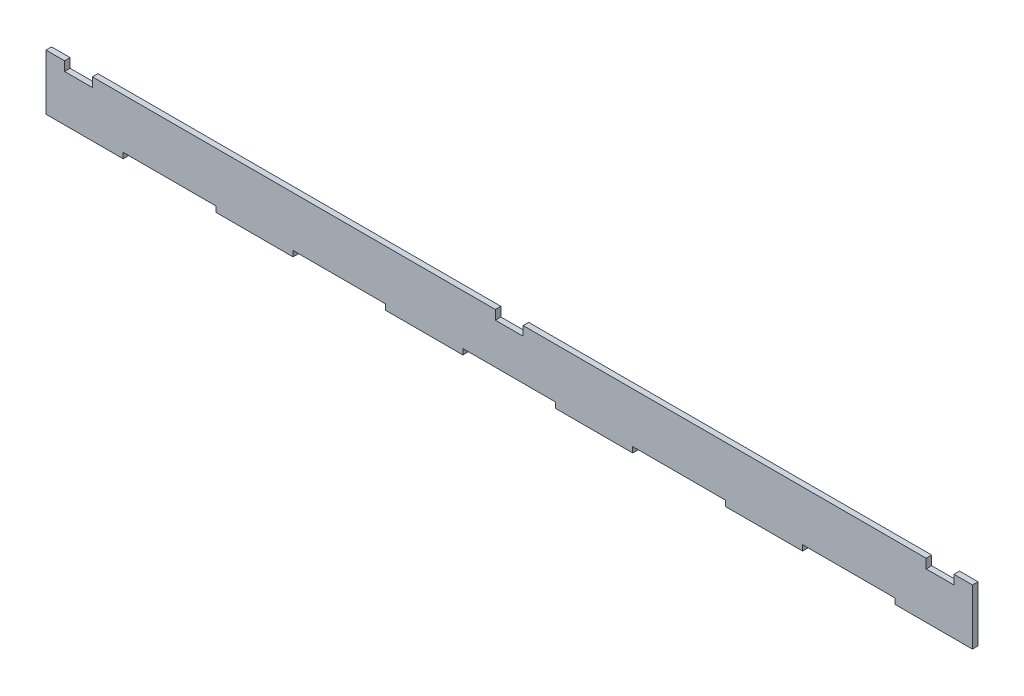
ISO-10303-21;
HEADER;
FILE_DESCRIPTION(('STEP AP214'),'2;1');
FILE_NAME('part.step','',(''),(''),'','','');
FILE_SCHEMA(('AUTOMOTIVE_DESIGN { 1 0 10303 214 1 1 1 1 }'));
ENDSEC;
DATA;
#1=APPLICATION_CONTEXT('core data for automotive mechanical design processes');
#2=APPLICATION_PROTOCOL_DEFINITION('international standard','automotive_design',2000,#1);
#3=PRODUCT_CONTEXT('',#1,'mechanical');
#4=PRODUCT('Part','Part','',(#3));
#5=PRODUCT_RELATED_PRODUCT_CATEGORY('part','',(#4));
#6=PRODUCT_DEFINITION_FORMATION('','',#4);
#7=PRODUCT_DEFINITION_CONTEXT('part definition',#1,'design');
#8=PRODUCT_DEFINITION('design','',#6,#7);
#9=PRODUCT_DEFINITION_SHAPE('','',#8);
#10=(LENGTH_UNIT() NAMED_UNIT(*) SI_UNIT(.MILLI.,.METRE.));
#11=(NAMED_UNIT(*) PLANE_ANGLE_UNIT() SI_UNIT($,.RADIAN.));
#12=(NAMED_UNIT(*) SI_UNIT($,.STERADIAN.) SOLID_ANGLE_UNIT());
#13=UNCERTAINTY_MEASURE_WITH_UNIT(LENGTH_MEASURE(1.E-05),#10,'distance_accuracy_value','');
#14=(GEOMETRIC_REPRESENTATION_CONTEXT(3) GLOBAL_UNCERTAINTY_ASSIGNED_CONTEXT((#13)) GLOBAL_UNIT_ASSIGNED_CONTEXT((#10,
#11,#12)) REPRESENTATION_CONTEXT('',''));
#15=CARTESIAN_POINT('',(0.,0.,0.));
#16=DIRECTION('',(0.,0.,1.));
#17=DIRECTION('',(1.,0.,0.));
#18=AXIS2_PLACEMENT_3D('',#15,#16,#17);
#19=CARTESIAN_POINT('',(0.,30.,3.));
#20=DIRECTION('',(0.,0.,-1.));
#21=DIRECTION('',(-1.,0.,0.));
#22=AXIS2_PLACEMENT_3D('',#19,#20,#21);
#23=PLANE('',#22);
#24=DIRECTION('',(0.,-1.,0.));
#25=VECTOR('',#24,1.);
#26=CARTESIAN_POINT('',(458.333333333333,0.,3.));
#27=LINE('',#26,#25);
#28=CARTESIAN_POINT('',(458.333333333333,3.,3.));
#29=VERTEX_POINT('',#28);
#30=CARTESIAN_POINT('',(458.333333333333,0.,3.));
#31=VERTEX_POINT('',#30);
#32=EDGE_CURVE('E540',#29,#31,#27,.T.);
#33=ORIENTED_EDGE('',*,*,#32,.T.);
#34=DIRECTION('',(1.,0.,0.));
#35=VECTOR('',#34,1.);
#36=CARTESIAN_POINT('',(0.,0.,3.));
#37=LINE('',#36,#35);
#38=CARTESIAN_POINT('',(500.,0.,3.));
#39=VERTEX_POINT('',#38);
#40=EDGE_CURVE('E348',#31,#39,#37,.T.);
#41=ORIENTED_EDGE('',*,*,#40,.T.);
#42=DIRECTION('',(0.,1.,0.));
#43=VECTOR('',#42,1.);
#44=CARTESIAN_POINT('',(500.,0.,3.));
#45=LINE('',#44,#43);
#46=CARTESIAN_POINT('',(500.,30.,3.));
#47=VERTEX_POINT('',#46);
#48=EDGE_CURVE('E320',#39,#47,#45,.T.);
#49=ORIENTED_EDGE('',*,*,#48,.T.);
#50=DIRECTION('',(-1.,0.,0.));
#51=VECTOR('',#50,1.);
#52=CARTESIAN_POINT('',(0.,30.,3.));
#53=LINE('',#52,#51);
#54=CARTESIAN_POINT('',(490.,30.,3.));
#55=VERTEX_POINT('',#54);
#56=EDGE_CURVE('E311',#47,#55,#53,.T.);
#57=ORIENTED_EDGE('',*,*,#56,.T.);
#58=DIRECTION('',(0.,-1.,0.));
#59=VECTOR('',#58,1.);
#60=CARTESIAN_POINT('',(490.,30.,2.99999999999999));
#61=LINE('',#60,#59);
#62=CARTESIAN_POINT('',(490.,25.,2.99999999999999));
#63=VERTEX_POINT('',#62);
#64=EDGE_CURVE('E408',#55,#63,#61,.T.);
#65=ORIENTED_EDGE('',*,*,#64,.T.);
#66=DIRECTION('',(-1.,0.,0.));
#67=VECTOR('',#66,1.);
#68=CARTESIAN_POINT('',(475.,25.,2.99999999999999));
#69=LINE('',#68,#67);
#70=CARTESIAN_POINT('',(475.,25.,2.99999999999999));
#71=VERTEX_POINT('',#70);
#72=EDGE_CURVE('E412',#63,#71,#69,.T.);
#73=ORIENTED_EDGE('',*,*,#72,.T.);
#74=DIRECTION('',(0.,1.,0.));
#75=VECTOR('',#74,1.);
#76=CARTESIAN_POINT('',(475.,30.,2.99999999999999));
#77=LINE('',#76,#75);
#78=CARTESIAN_POINT('',(475.,30.,2.99999999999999));
#79=VERTEX_POINT('',#78);
#80=EDGE_CURVE('E419',#71,#79,#77,.T.);
#81=ORIENTED_EDGE('',*,*,#80,.T.);
#82=CARTESIAN_POINT('',(257.5,30.,3.));
#83=VERTEX_POINT('',#82);
#84=EDGE_CURVE('E336',#79,#83,#53,.T.);
#85=ORIENTED_EDGE('',*,*,#84,.T.);
#86=DIRECTION('',(0.,-1.,0.));
#87=VECTOR('',#86,1.);
#88=CARTESIAN_POINT('',(257.5,30.,3.));
#89=LINE('',#88,#87);
#90=CARTESIAN_POINT('',(257.5,25.,3.));
#91=VERTEX_POINT('',#90);
#92=EDGE_CURVE('E372',#83,#91,#89,.T.);
#93=ORIENTED_EDGE('',*,*,#92,.T.);
#94=DIRECTION('',(-1.,0.,0.));
#95=VECTOR('',#94,1.);
#96=CARTESIAN_POINT('',(242.5,25.,3.));
#97=LINE('',#96,#95);
#98=CARTESIAN_POINT('',(242.5,25.,3.));
#99=VERTEX_POINT('',#98);
#100=EDGE_CURVE('E388',#91,#99,#97,.T.);
#101=ORIENTED_EDGE('',*,*,#100,.T.);
#102=DIRECTION('',(0.,1.,0.));
#103=VECTOR('',#102,1.);
#104=CARTESIAN_POINT('',(242.5,30.,3.));
#105=LINE('',#104,#103);
#106=CARTESIAN_POINT('',(242.5,30.,3.));
#107=VERTEX_POINT('',#106);
#108=EDGE_CURVE('E396',#99,#107,#105,.T.);
#109=ORIENTED_EDGE('',*,*,#108,.T.);
#110=CARTESIAN_POINT('',(25.,30.,3.00000000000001));
#111=VERTEX_POINT('',#110);
#112=EDGE_CURVE('E338',#107,#111,#53,.T.);
#113=ORIENTED_EDGE('',*,*,#112,.T.);
#114=DIRECTION('',(0.,-1.,0.));
#115=VECTOR('',#114,1.);
#116=CARTESIAN_POINT('',(25.,30.,3.));
#117=LINE('',#116,#115);
#118=CARTESIAN_POINT('',(25.,25.,3.));
#119=VERTEX_POINT('',#118);
#120=EDGE_CURVE('E354',#111,#119,#117,.T.);
#121=ORIENTED_EDGE('',*,*,#120,.T.);
#122=DIRECTION('',(-1.,0.,0.));
#123=VECTOR('',#122,1.);
#124=CARTESIAN_POINT('',(10.,25.,3.));
#125=LINE('',#124,#123);
#126=CARTESIAN_POINT('',(10.,25.,3.));
#127=VERTEX_POINT('',#126);
#128=EDGE_CURVE('E375',#119,#127,#125,.T.);
#129=ORIENTED_EDGE('',*,*,#128,.T.);
#130=DIRECTION('',(0.,1.,0.));
#131=VECTOR('',#130,1.);
#132=CARTESIAN_POINT('',(10.,30.,3.));
#133=LINE('',#132,#131);
#134=CARTESIAN_POINT('',(10.,30.,3.));
#135=VERTEX_POINT('',#134);
#136=EDGE_CURVE('E373',#127,#135,#133,.T.);
#137=ORIENTED_EDGE('',*,*,#136,.T.);
#138=CARTESIAN_POINT('',(0.,30.,3.));
#139=VERTEX_POINT('',#138);
#140=EDGE_CURVE('E337',#135,#139,#53,.T.);
#141=ORIENTED_EDGE('',*,*,#140,.T.);
#142=DIRECTION('',(0.,-1.,0.));
#143=VECTOR('',#142,1.);
#144=CARTESIAN_POINT('',(0.,0.,3.));
#145=LINE('',#144,#143);
#146=CARTESIAN_POINT('',(0.,0.,3.));
#147=VERTEX_POINT('',#146);
#148=EDGE_CURVE('E305',#139,#147,#145,.T.);
#149=ORIENTED_EDGE('',*,*,#148,.T.);
#150=CARTESIAN_POINT('',(41.6666666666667,0.,3.));
#151=VERTEX_POINT('',#150);
#152=EDGE_CURVE('E344',#147,#151,#37,.T.);
#153=ORIENTED_EDGE('',*,*,#152,.T.);
#154=DIRECTION('',(0.,1.,0.));
#155=VECTOR('',#154,1.);
#156=CARTESIAN_POINT('',(41.6666666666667,0.,3.));
#157=LINE('',#156,#155);
#158=CARTESIAN_POINT('',(41.6666666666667,3.,3.));
#159=VERTEX_POINT('',#158);
#160=EDGE_CURVE('E431',#151,#159,#157,.T.);
#161=ORIENTED_EDGE('',*,*,#160,.T.);
#162=DIRECTION('',(1.,0.,0.));
#163=VECTOR('',#162,1.);
#164=CARTESIAN_POINT('',(41.6666666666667,3.,3.));
#165=LINE('',#164,#163);
#166=CARTESIAN_POINT('',(91.6666666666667,3.,3.));
#167=VERTEX_POINT('',#166);
#168=EDGE_CURVE('E432',#159,#167,#165,.T.);
#169=ORIENTED_EDGE('',*,*,#168,.T.);
#170=DIRECTION('',(0.,-1.,0.));
#171=VECTOR('',#170,1.);
#172=CARTESIAN_POINT('',(91.6666666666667,0.,3.));
#173=LINE('',#172,#171);
#174=CARTESIAN_POINT('',(91.6666666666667,0.,3.));
#175=VERTEX_POINT('',#174);
#176=EDGE_CURVE('E435',#167,#175,#173,.T.);
#177=ORIENTED_EDGE('',*,*,#176,.T.);
#178=CARTESIAN_POINT('',(133.333333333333,0.,3.));
#179=VERTEX_POINT('',#178);
#180=EDGE_CURVE('E346',#175,#179,#37,.T.);
#181=ORIENTED_EDGE('',*,*,#180,.T.);
#182=DIRECTION('',(0.,1.,0.));
#183=VECTOR('',#182,1.);
#184=CARTESIAN_POINT('',(133.333333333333,0.,3.));
#185=LINE('',#184,#183);
#186=CARTESIAN_POINT('',(133.333333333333,3.,3.));
#187=VERTEX_POINT('',#186);
#188=EDGE_CURVE('E476',#179,#187,#185,.T.);
#189=ORIENTED_EDGE('',*,*,#188,.T.);
#190=DIRECTION('',(1.,0.,0.));
#191=VECTOR('',#190,1.);
#192=CARTESIAN_POINT('',(133.333333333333,3.,3.));
#193=LINE('',#192,#191);
#194=CARTESIAN_POINT('',(183.333333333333,3.,3.));
#195=VERTEX_POINT('',#194);
#196=EDGE_CURVE('E467',#187,#195,#193,.T.);
#197=ORIENTED_EDGE('',*,*,#196,.T.);
#198=DIRECTION('',(0.,-1.,0.));
#199=VECTOR('',#198,1.);
#200=CARTESIAN_POINT('',(183.333333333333,0.,3.));
#201=LINE('',#200,#199);
#202=CARTESIAN_POINT('',(183.333333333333,0.,3.));
#203=VERTEX_POINT('',#202);
#204=EDGE_CURVE('E454',#195,#203,#201,.T.);
#205=ORIENTED_EDGE('',*,*,#204,.T.);
#206=CARTESIAN_POINT('',(225.,0.,3.));
#207=VERTEX_POINT('',#206);
#208=EDGE_CURVE('E564',#203,#207,#37,.T.);
#209=ORIENTED_EDGE('',*,*,#208,.T.);
#210=DIRECTION('',(0.,1.,0.));
#211=VECTOR('',#210,1.);
#212=CARTESIAN_POINT('',(225.,0.,3.));
#213=LINE('',#212,#211);
#214=CARTESIAN_POINT('',(225.,3.,3.));
#215=VERTEX_POINT('',#214);
#216=EDGE_CURVE('E505',#207,#215,#213,.T.);
#217=ORIENTED_EDGE('',*,*,#216,.T.);
#218=DIRECTION('',(1.,0.,0.));
#219=VECTOR('',#218,1.);
#220=CARTESIAN_POINT('',(225.,3.,3.));
#221=LINE('',#220,#219);
#222=CARTESIAN_POINT('',(275.,3.,3.));
#223=VERTEX_POINT('',#222);
#224=EDGE_CURVE('E496',#215,#223,#221,.T.);
#225=ORIENTED_EDGE('',*,*,#224,.T.);
#226=DIRECTION('',(0.,-1.,0.));
#227=VECTOR('',#226,1.);
#228=CARTESIAN_POINT('',(275.,0.,3.));
#229=LINE('',#228,#227);
#230=CARTESIAN_POINT('',(275.,0.,3.));
#231=VERTEX_POINT('',#230);
#232=EDGE_CURVE('E487',#223,#231,#229,.T.);
#233=ORIENTED_EDGE('',*,*,#232,.T.);
#234=CARTESIAN_POINT('',(316.666666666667,0.,3.));
#235=VERTEX_POINT('',#234);
#236=EDGE_CURVE('E562',#231,#235,#37,.T.);
#237=ORIENTED_EDGE('',*,*,#236,.T.);
#238=DIRECTION('',(0.,1.,0.));
#239=VECTOR('',#238,1.);
#240=CARTESIAN_POINT('',(316.666666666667,0.,3.));
#241=LINE('',#240,#239);
#242=CARTESIAN_POINT('',(316.666666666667,3.,3.));
#243=VERTEX_POINT('',#242);
#244=EDGE_CURVE('E56',#235,#243,#241,.T.);
#245=ORIENTED_EDGE('',*,*,#244,.T.);
#246=DIRECTION('',(1.,0.,0.));
#247=VECTOR('',#246,1.);
#248=CARTESIAN_POINT('',(316.666666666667,3.,3.));
#249=LINE('',#248,#247);
#250=CARTESIAN_POINT('',(366.666666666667,3.,3.));
#251=VERTEX_POINT('',#250);
#252=EDGE_CURVE('E522',#243,#251,#249,.T.);
#253=ORIENTED_EDGE('',*,*,#252,.T.);
#254=DIRECTION('',(0.,-1.,0.));
#255=VECTOR('',#254,1.);
#256=CARTESIAN_POINT('',(366.666666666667,0.,3.));
#257=LINE('',#256,#255);
#258=CARTESIAN_POINT('',(366.666666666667,0.,3.));
#259=VERTEX_POINT('',#258);
#260=EDGE_CURVE('E516',#251,#259,#257,.T.);
#261=ORIENTED_EDGE('',*,*,#260,.T.);
#262=CARTESIAN_POINT('',(408.333333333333,0.,3.));
#263=VERTEX_POINT('',#262);
#264=EDGE_CURVE('E560',#259,#263,#37,.T.);
#265=ORIENTED_EDGE('',*,*,#264,.T.);
#266=DIRECTION('',(0.,1.,0.));
#267=VECTOR('',#266,1.);
#268=CARTESIAN_POINT('',(408.333333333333,0.,3.));
#269=LINE('',#268,#267);
#270=CARTESIAN_POINT('',(408.333333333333,3.,3.));
#271=VERTEX_POINT('',#270);
#272=EDGE_CURVE('E48',#263,#271,#269,.T.);
#273=ORIENTED_EDGE('',*,*,#272,.T.);
#274=DIRECTION('',(1.,0.,0.));
#275=VECTOR('',#274,1.);
#276=CARTESIAN_POINT('',(408.333333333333,3.,3.));
#277=LINE('',#276,#275);
#278=EDGE_CURVE('E548',#271,#29,#277,.T.);
#279=ORIENTED_EDGE('',*,*,#278,.T.);
#280=EDGE_LOOP('',(#33,#41,#49,#57,#65,#73,#81,#85,#93,#101,#109,#113,#121,#129,#137,#141,#149,
#153,#161,#169,#177,#181,#189,#197,#205,#209,#217,#225,#233,#237,#245,#253,#261,#265,#273,#279));
#281=FACE_BOUND('',#280,.T.);
#282=ADVANCED_FACE('F33',(#281),#23,.F.);
#283=CARTESIAN_POINT('',(0.,30.,0.));
#284=DIRECTION('',(0.,0.,-1.));
#285=DIRECTION('',(-1.,0.,0.));
#286=AXIS2_PLACEMENT_3D('',#283,#284,#285);
#287=PLANE('',#286);
#288=DIRECTION('',(1.,0.,0.));
#289=VECTOR('',#288,1.);
#290=CARTESIAN_POINT('',(0.,0.,0.));
#291=LINE('',#290,#289);
#292=CARTESIAN_POINT('',(458.333333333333,0.,0.));
#293=VERTEX_POINT('',#292);
#294=CARTESIAN_POINT('',(500.,0.,0.));
#295=VERTEX_POINT('',#294);
#296=EDGE_CURVE('E288',#293,#295,#291,.T.);
#297=ORIENTED_EDGE('',*,*,#296,.F.);
#298=DIRECTION('',(0.,1.,0.));
#299=VECTOR('',#298,1.);
#300=CARTESIAN_POINT('',(458.333333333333,0.,0.));
#301=LINE('',#300,#299);
#302=CARTESIAN_POINT('',(458.333333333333,3.,0.));
#303=VERTEX_POINT('',#302);
#304=EDGE_CURVE('E546',#293,#303,#301,.T.);
#305=ORIENTED_EDGE('',*,*,#304,.T.);
#306=DIRECTION('',(-1.,0.,0.));
#307=VECTOR('',#306,1.);
#308=CARTESIAN_POINT('',(408.333333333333,3.,0.));
#309=LINE('',#308,#307);
#310=CARTESIAN_POINT('',(408.333333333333,3.,0.));
#311=VERTEX_POINT('',#310);
#312=EDGE_CURVE('E281',#303,#311,#309,.T.);
#313=ORIENTED_EDGE('',*,*,#312,.T.);
#314=DIRECTION('',(0.,-1.,0.));
#315=VECTOR('',#314,1.);
#316=CARTESIAN_POINT('',(408.333333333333,0.,0.));
#317=LINE('',#316,#315);
#318=CARTESIAN_POINT('',(408.333333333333,0.,0.));
#319=VERTEX_POINT('',#318);
#320=EDGE_CURVE('E266',#311,#319,#317,.T.);
#321=ORIENTED_EDGE('',*,*,#320,.T.);
#322=CARTESIAN_POINT('',(366.666666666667,0.,0.));
#323=VERTEX_POINT('',#322);
#324=EDGE_CURVE('E279',#323,#319,#291,.T.);
#325=ORIENTED_EDGE('',*,*,#324,.F.);
#326=DIRECTION('',(0.,1.,0.));
#327=VECTOR('',#326,1.);
#328=CARTESIAN_POINT('',(366.666666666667,0.,0.));
#329=LINE('',#328,#327);
#330=CARTESIAN_POINT('',(366.666666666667,3.,0.));
#331=VERTEX_POINT('',#330);
#332=EDGE_CURVE('E520',#323,#331,#329,.T.);
#333=ORIENTED_EDGE('',*,*,#332,.T.);
#334=DIRECTION('',(-1.,0.,0.));
#335=VECTOR('',#334,1.);
#336=CARTESIAN_POINT('',(316.666666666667,3.,0.));
#337=LINE('',#336,#335);
#338=CARTESIAN_POINT('',(316.666666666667,3.,0.));
#339=VERTEX_POINT('',#338);
#340=EDGE_CURVE('E528',#331,#339,#337,.T.);
#341=ORIENTED_EDGE('',*,*,#340,.T.);
#342=DIRECTION('',(0.,-1.,0.));
#343=VECTOR('',#342,1.);
#344=CARTESIAN_POINT('',(316.666666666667,0.,0.));
#345=LINE('',#344,#343);
#346=CARTESIAN_POINT('',(316.666666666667,0.,0.));
#347=VERTEX_POINT('',#346);
#348=EDGE_CURVE('E535',#339,#347,#345,.T.);
#349=ORIENTED_EDGE('',*,*,#348,.T.);
#350=CARTESIAN_POINT('',(275.,0.,0.));
#351=VERTEX_POINT('',#350);
#352=EDGE_CURVE('E287',#351,#347,#291,.T.);
#353=ORIENTED_EDGE('',*,*,#352,.F.);
#354=DIRECTION('',(0.,1.,0.));
#355=VECTOR('',#354,1.);
#356=CARTESIAN_POINT('',(275.,0.,0.));
#357=LINE('',#356,#355);
#358=CARTESIAN_POINT('',(275.,3.,0.));
#359=VERTEX_POINT('',#358);
#360=EDGE_CURVE('E493',#351,#359,#357,.T.);
#361=ORIENTED_EDGE('',*,*,#360,.T.);
#362=DIRECTION('',(-1.,0.,0.));
#363=VECTOR('',#362,1.);
#364=CARTESIAN_POINT('',(225.,3.,0.));
#365=LINE('',#364,#363);
#366=CARTESIAN_POINT('',(225.,3.,0.));
#367=VERTEX_POINT('',#366);
#368=EDGE_CURVE('E502',#359,#367,#365,.T.);
#369=ORIENTED_EDGE('',*,*,#368,.T.);
#370=DIRECTION('',(0.,-1.,0.));
#371=VECTOR('',#370,1.);
#372=CARTESIAN_POINT('',(225.,0.,0.));
#373=LINE('',#372,#371);
#374=CARTESIAN_POINT('',(225.,0.,0.));
#375=VERTEX_POINT('',#374);
#376=EDGE_CURVE('E511',#367,#375,#373,.T.);
#377=ORIENTED_EDGE('',*,*,#376,.T.);
#378=CARTESIAN_POINT('',(183.333333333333,0.,0.));
#379=VERTEX_POINT('',#378);
#380=EDGE_CURVE('E291',#379,#375,#291,.T.);
#381=ORIENTED_EDGE('',*,*,#380,.F.);
#382=DIRECTION('',(0.,1.,0.));
#383=VECTOR('',#382,1.);
#384=CARTESIAN_POINT('',(183.333333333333,0.,0.));
#385=LINE('',#384,#383);
#386=CARTESIAN_POINT('',(183.333333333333,3.,0.));
#387=VERTEX_POINT('',#386);
#388=EDGE_CURVE('E464',#379,#387,#385,.T.);
#389=ORIENTED_EDGE('',*,*,#388,.T.);
#390=DIRECTION('',(-1.,0.,0.));
#391=VECTOR('',#390,1.);
#392=CARTESIAN_POINT('',(133.333333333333,3.,0.));
#393=LINE('',#392,#391);
#394=CARTESIAN_POINT('',(133.333333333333,3.,0.));
#395=VERTEX_POINT('',#394);
#396=EDGE_CURVE('E473',#387,#395,#393,.T.);
#397=ORIENTED_EDGE('',*,*,#396,.T.);
#398=DIRECTION('',(0.,-1.,0.));
#399=VECTOR('',#398,1.);
#400=CARTESIAN_POINT('',(133.333333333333,0.,0.));
#401=LINE('',#400,#399);
#402=CARTESIAN_POINT('',(133.333333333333,0.,0.));
#403=VERTEX_POINT('',#402);
#404=EDGE_CURVE('E482',#395,#403,#401,.T.);
#405=ORIENTED_EDGE('',*,*,#404,.T.);
#406=CARTESIAN_POINT('',(91.6666666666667,0.,0.));
#407=VERTEX_POINT('',#406);
#408=EDGE_CURVE('E298',#407,#403,#291,.T.);
#409=ORIENTED_EDGE('',*,*,#408,.F.);
#410=DIRECTION('',(0.,1.,0.));
#411=VECTOR('',#410,1.);
#412=CARTESIAN_POINT('',(91.6666666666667,0.,0.));
#413=LINE('',#412,#411);
#414=CARTESIAN_POINT('',(91.6666666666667,3.,0.));
#415=VERTEX_POINT('',#414);
#416=EDGE_CURVE('E448',#407,#415,#413,.T.);
#417=ORIENTED_EDGE('',*,*,#416,.T.);
#418=DIRECTION('',(-1.,0.,0.));
#419=VECTOR('',#418,1.);
#420=CARTESIAN_POINT('',(41.6666666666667,3.,0.));
#421=LINE('',#420,#419);
#422=CARTESIAN_POINT('',(41.6666666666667,3.,0.));
#423=VERTEX_POINT('',#422);
#424=EDGE_CURVE('E445',#415,#423,#421,.T.);
#425=ORIENTED_EDGE('',*,*,#424,.T.);
#426=DIRECTION('',(0.,-1.,0.));
#427=VECTOR('',#426,1.);
#428=CARTESIAN_POINT('',(41.6666666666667,0.,0.));
#429=LINE('',#428,#427);
#430=CARTESIAN_POINT('',(41.6666666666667,0.,0.));
#431=VERTEX_POINT('',#430);
#432=EDGE_CURVE('E451',#423,#431,#429,.T.);
#433=ORIENTED_EDGE('',*,*,#432,.T.);
#434=CARTESIAN_POINT('',(0.,0.,0.));
#435=VERTEX_POINT('',#434);
#436=EDGE_CURVE('E293',#435,#431,#291,.T.);
#437=ORIENTED_EDGE('',*,*,#436,.F.);
#438=DIRECTION('',(0.,-1.,0.));
#439=VECTOR('',#438,1.);
#440=CARTESIAN_POINT('',(0.,0.,0.));
#441=LINE('',#440,#439);
#442=CARTESIAN_POINT('',(0.,30.,0.));
#443=VERTEX_POINT('',#442);
#444=EDGE_CURVE('E292',#443,#435,#441,.T.);
#445=ORIENTED_EDGE('',*,*,#444,.F.);
#446=DIRECTION('',(-1.,0.,0.));
#447=VECTOR('',#446,1.);
#448=CARTESIAN_POINT('',(0.,30.,0.));
#449=LINE('',#448,#447);
#450=CARTESIAN_POINT('',(10.,30.,0.));
#451=VERTEX_POINT('',#450);
#452=EDGE_CURVE('E301',#451,#443,#449,.T.);
#453=ORIENTED_EDGE('',*,*,#452,.F.);
#454=DIRECTION('',(0.,-1.,0.));
#455=VECTOR('',#454,1.);
#456=CARTESIAN_POINT('',(10.,30.,0.));
#457=LINE('',#456,#455);
#458=CARTESIAN_POINT('',(10.,25.,0.));
#459=VERTEX_POINT('',#458);
#460=EDGE_CURVE('E369',#451,#459,#457,.T.);
#461=ORIENTED_EDGE('',*,*,#460,.T.);
#462=DIRECTION('',(1.,0.,0.));
#463=VECTOR('',#462,1.);
#464=CARTESIAN_POINT('',(10.,25.,0.));
#465=LINE('',#464,#463);
#466=CARTESIAN_POINT('',(25.,25.,0.));
#467=VERTEX_POINT('',#466);
#468=EDGE_CURVE('E366',#459,#467,#465,.T.);
#469=ORIENTED_EDGE('',*,*,#468,.T.);
#470=DIRECTION('',(0.,1.,0.));
#471=VECTOR('',#470,1.);
#472=CARTESIAN_POINT('',(25.,30.,0.));
#473=LINE('',#472,#471);
#474=CARTESIAN_POINT('',(25.,30.,0.));
#475=VERTEX_POINT('',#474);
#476=EDGE_CURVE('E363',#467,#475,#473,.T.);
#477=ORIENTED_EDGE('',*,*,#476,.T.);
#478=CARTESIAN_POINT('',(242.5,30.,0.));
#479=VERTEX_POINT('',#478);
#480=EDGE_CURVE('E948',#479,#475,#449,.T.);
#481=ORIENTED_EDGE('',*,*,#480,.F.);
#482=DIRECTION('',(0.,-1.,0.));
#483=VECTOR('',#482,1.);
#484=CARTESIAN_POINT('',(242.5,30.,0.));
#485=LINE('',#484,#483);
#486=CARTESIAN_POINT('',(242.5,25.,0.));
#487=VERTEX_POINT('',#486);
#488=EDGE_CURVE('E405',#479,#487,#485,.T.);
#489=ORIENTED_EDGE('',*,*,#488,.T.);
#490=DIRECTION('',(1.,0.,0.));
#491=VECTOR('',#490,1.);
#492=CARTESIAN_POINT('',(242.5,25.,0.));
#493=LINE('',#492,#491);
#494=CARTESIAN_POINT('',(257.5,25.,0.));
#495=VERTEX_POINT('',#494);
#496=EDGE_CURVE('E391',#487,#495,#493,.T.);
#497=ORIENTED_EDGE('',*,*,#496,.T.);
#498=DIRECTION('',(0.,1.,0.));
#499=VECTOR('',#498,1.);
#500=CARTESIAN_POINT('',(257.5,30.,0.));
#501=LINE('',#500,#499);
#502=CARTESIAN_POINT('',(257.5,30.,0.));
#503=VERTEX_POINT('',#502);
#504=EDGE_CURVE('E382',#495,#503,#501,.T.);
#505=ORIENTED_EDGE('',*,*,#504,.T.);
#506=CARTESIAN_POINT('',(475.,30.,0.));
#507=VERTEX_POINT('',#506);
#508=EDGE_CURVE('E306',#507,#503,#449,.T.);
#509=ORIENTED_EDGE('',*,*,#508,.F.);
#510=DIRECTION('',(0.,-1.,0.));
#511=VECTOR('',#510,1.);
#512=CARTESIAN_POINT('',(475.,30.,0.));
#513=LINE('',#512,#511);
#514=CARTESIAN_POINT('',(475.,25.,0.));
#515=VERTEX_POINT('',#514);
#516=EDGE_CURVE('E428',#507,#515,#513,.T.);
#517=ORIENTED_EDGE('',*,*,#516,.T.);
#518=DIRECTION('',(1.,0.,0.));
#519=VECTOR('',#518,1.);
#520=CARTESIAN_POINT('',(475.,25.,0.));
#521=LINE('',#520,#519);
#522=CARTESIAN_POINT('',(490.,25.,0.));
#523=VERTEX_POINT('',#522);
#524=EDGE_CURVE('E415',#515,#523,#521,.T.);
#525=ORIENTED_EDGE('',*,*,#524,.T.);
#526=DIRECTION('',(0.,1.,0.));
#527=VECTOR('',#526,1.);
#528=CARTESIAN_POINT('',(490.,30.,0.));
#529=LINE('',#528,#527);
#530=CARTESIAN_POINT('',(490.,30.,0.));
#531=VERTEX_POINT('',#530);
#532=EDGE_CURVE('E327',#523,#531,#529,.T.);
#533=ORIENTED_EDGE('',*,*,#532,.T.);
#534=CARTESIAN_POINT('',(500.,30.,0.));
#535=VERTEX_POINT('',#534);
#536=EDGE_CURVE('E302',#535,#531,#449,.T.);
#537=ORIENTED_EDGE('',*,*,#536,.F.);
#538=DIRECTION('',(0.,1.,0.));
#539=VECTOR('',#538,1.);
#540=CARTESIAN_POINT('',(500.,0.,0.));
#541=LINE('',#540,#539);
#542=EDGE_CURVE('E297',#295,#535,#541,.T.);
#543=ORIENTED_EDGE('',*,*,#542,.F.);
#544=EDGE_LOOP('',(#297,#305,#313,#321,#325,#333,#341,#349,#353,#361,#369,#377,#381,#389,#397,
#405,#409,#417,#425,#433,#437,#445,#453,#461,#469,#477,#481,#489,#497,#505,#509,#517,#525,#533,
#537,#543));
#545=FACE_BOUND('',#544,.T.);
#546=ADVANCED_FACE('F277',(#545),#287,.T.);
#547=CARTESIAN_POINT('',(0.,0.,3.));
#548=DIRECTION('',(0.,1.,0.));
#549=DIRECTION('',(0.,0.,1.));
#550=AXIS2_PLACEMENT_3D('',#547,#548,#549);
#551=PLANE('',#550);
#552=DIRECTION('',(0.,0.,-1.));
#553=VECTOR('',#552,1.);
#554=CARTESIAN_POINT('',(458.333333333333,0.,53.0899191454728));
#555=LINE('',#554,#553);
#556=EDGE_CURVE('E543',#31,#293,#555,.T.);
#557=ORIENTED_EDGE('',*,*,#556,.T.);
#558=ORIENTED_EDGE('',*,*,#296,.T.);
#559=DIRECTION('',(0.,0.,-1.));
#560=VECTOR('',#559,1.);
#561=CARTESIAN_POINT('',(500.,0.,3.));
#562=LINE('',#561,#560);
#563=EDGE_CURVE('E41',#39,#295,#562,.T.);
#564=ORIENTED_EDGE('',*,*,#563,.F.);
#565=ORIENTED_EDGE('',*,*,#40,.F.);
#566=EDGE_LOOP('',(#557,#558,#564,#565));
#567=FACE_BOUND('',#566,.T.);
#568=ADVANCED_FACE('F565',(#567),#551,.F.);
#569=DIRECTION('',(0.,0.,-1.));
#570=VECTOR('',#569,1.);
#571=CARTESIAN_POINT('',(408.333333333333,0.,53.0899191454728));
#572=LINE('',#571,#570);
#573=EDGE_CURVE('E263',#263,#319,#572,.T.);
#574=ORIENTED_EDGE('',*,*,#573,.F.);
#575=ORIENTED_EDGE('',*,*,#264,.F.);
#576=DIRECTION('',(0.,0.,-1.));
#577=VECTOR('',#576,1.);
#578=CARTESIAN_POINT('',(366.666666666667,0.,53.0899191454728));
#579=LINE('',#578,#577);
#580=EDGE_CURVE('E286',#259,#323,#579,.T.);
#581=ORIENTED_EDGE('',*,*,#580,.T.);
#582=ORIENTED_EDGE('',*,*,#324,.T.);
#583=EDGE_LOOP('',(#574,#575,#581,#582));
#584=FACE_BOUND('',#583,.T.);
#585=ADVANCED_FACE('F285',(#584),#551,.F.);
#586=DIRECTION('',(0.,0.,-1.));
#587=VECTOR('',#586,1.);
#588=CARTESIAN_POINT('',(316.666666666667,0.,53.0899191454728));
#589=LINE('',#588,#587);
#590=EDGE_CURVE('E538',#235,#347,#589,.T.);
#591=ORIENTED_EDGE('',*,*,#590,.F.);
#592=ORIENTED_EDGE('',*,*,#236,.F.);
#593=DIRECTION('',(0.,0.,-1.));
#594=VECTOR('',#593,1.);
#595=CARTESIAN_POINT('',(275.,0.,53.0899191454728));
#596=LINE('',#595,#594);
#597=EDGE_CURVE('E490',#231,#351,#596,.T.);
#598=ORIENTED_EDGE('',*,*,#597,.T.);
#599=ORIENTED_EDGE('',*,*,#352,.T.);
#600=EDGE_LOOP('',(#591,#592,#598,#599));
#601=FACE_BOUND('',#600,.T.);
#602=ADVANCED_FACE('F600',(#601),#551,.F.);
#603=DIRECTION('',(0.,0.,-1.));
#604=VECTOR('',#603,1.);
#605=CARTESIAN_POINT('',(225.,0.,53.0899191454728));
#606=LINE('',#605,#604);
#607=EDGE_CURVE('E514',#207,#375,#606,.T.);
#608=ORIENTED_EDGE('',*,*,#607,.F.);
#609=ORIENTED_EDGE('',*,*,#208,.F.);
#610=DIRECTION('',(0.,0.,-1.));
#611=VECTOR('',#610,1.);
#612=CARTESIAN_POINT('',(183.333333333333,0.,53.0899191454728));
#613=LINE('',#612,#611);
#614=EDGE_CURVE('E461',#203,#379,#613,.T.);
#615=ORIENTED_EDGE('',*,*,#614,.T.);
#616=ORIENTED_EDGE('',*,*,#380,.T.);
#617=EDGE_LOOP('',(#608,#609,#615,#616));
#618=FACE_BOUND('',#617,.T.);
#619=ADVANCED_FACE('F607',(#618),#551,.F.);
#620=DIRECTION('',(0.,0.,-1.));
#621=VECTOR('',#620,1.);
#622=CARTESIAN_POINT('',(133.333333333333,0.,53.0899191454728));
#623=LINE('',#622,#621);
#624=EDGE_CURVE('E485',#179,#403,#623,.T.);
#625=ORIENTED_EDGE('',*,*,#624,.F.);
#626=ORIENTED_EDGE('',*,*,#180,.F.);
#627=DIRECTION('',(0.,0.,-1.));
#628=VECTOR('',#627,1.);
#629=CARTESIAN_POINT('',(91.6666666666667,0.,53.0899191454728));
#630=LINE('',#629,#628);
#631=EDGE_CURVE('E438',#175,#407,#630,.T.);
#632=ORIENTED_EDGE('',*,*,#631,.T.);
#633=ORIENTED_EDGE('',*,*,#408,.T.);
#634=EDGE_LOOP('',(#625,#626,#632,#633));
#635=FACE_BOUND('',#634,.T.);
#636=ADVANCED_FACE('F602',(#635),#551,.F.);
#637=DIRECTION('',(0.,0.,-1.));
#638=VECTOR('',#637,1.);
#639=CARTESIAN_POINT('',(41.6666666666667,0.,53.0899191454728));
#640=LINE('',#639,#638);
#641=EDGE_CURVE('E436',#151,#431,#640,.T.);
#642=ORIENTED_EDGE('',*,*,#641,.F.);
#643=ORIENTED_EDGE('',*,*,#152,.F.);
#644=DIRECTION('',(0.,0.,-1.));
#645=VECTOR('',#644,1.);
#646=CARTESIAN_POINT('',(0.,0.,3.));
#647=LINE('',#646,#645);
#648=EDGE_CURVE('E11',#147,#435,#647,.T.);
#649=ORIENTED_EDGE('',*,*,#648,.T.);
#650=ORIENTED_EDGE('',*,*,#436,.T.);
#651=EDGE_LOOP('',(#642,#643,#649,#650));
#652=FACE_BOUND('',#651,.T.);
#653=ADVANCED_FACE('F592',(#652),#551,.F.);
#654=CARTESIAN_POINT('',(0.,30.,3.));
#655=DIRECTION('',(0.,-1.,0.));
#656=DIRECTION('',(0.,0.,-1.));
#657=AXIS2_PLACEMENT_3D('',#654,#655,#656);
#658=PLANE('',#657);
#659=DIRECTION('',(0.,0.,-1.));
#660=VECTOR('',#659,1.);
#661=CARTESIAN_POINT('',(490.,30.,18.8113883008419));
#662=LINE('',#661,#660);
#663=EDGE_CURVE('E332',#55,#531,#662,.T.);
#664=ORIENTED_EDGE('',*,*,#663,.F.);
#665=ORIENTED_EDGE('',*,*,#56,.F.);
#666=DIRECTION('',(0.,0.,-1.));
#667=VECTOR('',#666,1.);
#668=CARTESIAN_POINT('',(500.,30.,3.));
#669=LINE('',#668,#667);
#670=EDGE_CURVE('E310',#47,#535,#669,.T.);
#671=ORIENTED_EDGE('',*,*,#670,.T.);
#672=ORIENTED_EDGE('',*,*,#536,.T.);
#673=EDGE_LOOP('',(#664,#665,#671,#672));
#674=FACE_BOUND('',#673,.T.);
#675=ADVANCED_FACE('F330',(#674),#658,.F.);
#676=DIRECTION('',(0.,0.,-1.));
#677=VECTOR('',#676,1.);
#678=CARTESIAN_POINT('',(475.,30.,18.8113883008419));
#679=LINE('',#678,#677);
#680=EDGE_CURVE('E422',#79,#507,#679,.T.);
#681=ORIENTED_EDGE('',*,*,#680,.T.);
#682=ORIENTED_EDGE('',*,*,#508,.T.);
#683=DIRECTION('',(0.,0.,-1.));
#684=VECTOR('',#683,1.);
#685=CARTESIAN_POINT('',(257.5,30.,18.8113883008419));
#686=LINE('',#685,#684);
#687=EDGE_CURVE('E385',#83,#503,#686,.T.);
#688=ORIENTED_EDGE('',*,*,#687,.F.);
#689=ORIENTED_EDGE('',*,*,#84,.F.);
#690=EDGE_LOOP('',(#681,#682,#688,#689));
#691=FACE_BOUND('',#690,.T.);
#692=ADVANCED_FACE('F591',(#691),#658,.F.);
#693=DIRECTION('',(0.,0.,-1.));
#694=VECTOR('',#693,1.);
#695=CARTESIAN_POINT('',(242.5,30.,18.8113883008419));
#696=LINE('',#695,#694);
#697=EDGE_CURVE('E399',#107,#479,#696,.T.);
#698=ORIENTED_EDGE('',*,*,#697,.T.);
#699=ORIENTED_EDGE('',*,*,#480,.T.);
#700=DIRECTION('',(0.,0.,-1.));
#701=VECTOR('',#700,1.);
#702=CARTESIAN_POINT('',(25.,30.,18.8113883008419));
#703=LINE('',#702,#701);
#704=EDGE_CURVE('E357',#111,#475,#703,.T.);
#705=ORIENTED_EDGE('',*,*,#704,.F.);
#706=ORIENTED_EDGE('',*,*,#112,.F.);
#707=EDGE_LOOP('',(#698,#699,#705,#706));
#708=FACE_BOUND('',#707,.T.);
#709=ADVANCED_FACE('F875',(#708),#658,.F.);
#710=DIRECTION('',(0.,0.,-1.));
#711=VECTOR('',#710,1.);
#712=CARTESIAN_POINT('',(10.,30.,18.8113883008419));
#713=LINE('',#712,#711);
#714=EDGE_CURVE('E360',#135,#451,#713,.T.);
#715=ORIENTED_EDGE('',*,*,#714,.T.);
#716=ORIENTED_EDGE('',*,*,#452,.T.);
#717=DIRECTION('',(0.,0.,-1.));
#718=VECTOR('',#717,1.);
#719=CARTESIAN_POINT('',(0.,30.,3.));
#720=LINE('',#719,#718);
#721=EDGE_CURVE('E307',#139,#443,#720,.T.);
#722=ORIENTED_EDGE('',*,*,#721,.F.);
#723=ORIENTED_EDGE('',*,*,#140,.F.);
#724=EDGE_LOOP('',(#715,#716,#722,#723));
#725=FACE_BOUND('',#724,.T.);
#726=ADVANCED_FACE('F593',(#725),#658,.F.);
#727=CARTESIAN_POINT('',(0.,0.,3.));
#728=DIRECTION('',(1.,0.,0.));
#729=DIRECTION('',(0.,0.,-1.));
#730=AXIS2_PLACEMENT_3D('',#727,#728,#729);
#731=PLANE('',#730);
#732=ORIENTED_EDGE('',*,*,#444,.T.);
#733=ORIENTED_EDGE('',*,*,#648,.F.);
#734=ORIENTED_EDGE('',*,*,#148,.F.);
#735=ORIENTED_EDGE('',*,*,#721,.T.);
#736=EDGE_LOOP('',(#732,#733,#734,#735));
#737=FACE_BOUND('',#736,.T.);
#738=ADVANCED_FACE('F35',(#737),#731,.F.);
#739=CARTESIAN_POINT('',(500.,0.,3.));
#740=DIRECTION('',(-1.,0.,0.));
#741=DIRECTION('',(0.,0.,1.));
#742=AXIS2_PLACEMENT_3D('',#739,#740,#741);
#743=PLANE('',#742);
#744=ORIENTED_EDGE('',*,*,#542,.T.);
#745=ORIENTED_EDGE('',*,*,#670,.F.);
#746=ORIENTED_EDGE('',*,*,#48,.F.);
#747=ORIENTED_EDGE('',*,*,#563,.T.);
#748=EDGE_LOOP('',(#744,#745,#746,#747));
#749=FACE_BOUND('',#748,.T.);
#750=ADVANCED_FACE('F318',(#749),#743,.F.);
#751=CARTESIAN_POINT('',(25.,30.,18.8113883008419));
#752=DIRECTION('',(-1.,0.,0.));
#753=DIRECTION('',(0.,-1.,0.));
#754=AXIS2_PLACEMENT_3D('',#751,#752,#753);
#755=PLANE('',#754);
#756=ORIENTED_EDGE('',*,*,#704,.T.);
#757=ORIENTED_EDGE('',*,*,#476,.F.);
#758=DIRECTION('',(0.,0.,-1.));
#759=VECTOR('',#758,1.);
#760=CARTESIAN_POINT('',(25.,25.,18.8113883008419));
#761=LINE('',#760,#759);
#762=EDGE_CURVE('E355',#119,#467,#761,.T.);
#763=ORIENTED_EDGE('',*,*,#762,.F.);
#764=ORIENTED_EDGE('',*,*,#120,.F.);
#765=EDGE_LOOP('',(#756,#757,#763,#764));
#766=FACE_BOUND('',#765,.T.);
#767=ADVANCED_FACE('F595',(#766),#755,.T.);
#768=CARTESIAN_POINT('',(10.,25.,18.8113883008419));
#769=DIRECTION('',(0.,1.,0.));
#770=DIRECTION('',(0.,0.,1.));
#771=AXIS2_PLACEMENT_3D('',#768,#769,#770);
#772=PLANE('',#771);
#773=ORIENTED_EDGE('',*,*,#762,.T.);
#774=ORIENTED_EDGE('',*,*,#468,.F.);
#775=DIRECTION('',(0.,0.,-1.));
#776=VECTOR('',#775,1.);
#777=CARTESIAN_POINT('',(10.,25.,18.8113883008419));
#778=LINE('',#777,#776);
#779=EDGE_CURVE('E351',#127,#459,#778,.T.);
#780=ORIENTED_EDGE('',*,*,#779,.F.);
#781=ORIENTED_EDGE('',*,*,#128,.F.);
#782=EDGE_LOOP('',(#773,#774,#780,#781));
#783=FACE_BOUND('',#782,.T.);
#784=ADVANCED_FACE('F901',(#783),#772,.T.);
#785=CARTESIAN_POINT('',(10.,30.,18.8113883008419));
#786=DIRECTION('',(1.,0.,0.));
#787=DIRECTION('',(0.,0.,-1.));
#788=AXIS2_PLACEMENT_3D('',#785,#786,#787);
#789=PLANE('',#788);
#790=ORIENTED_EDGE('',*,*,#779,.T.);
#791=ORIENTED_EDGE('',*,*,#460,.F.);
#792=ORIENTED_EDGE('',*,*,#714,.F.);
#793=ORIENTED_EDGE('',*,*,#136,.F.);
#794=EDGE_LOOP('',(#790,#791,#792,#793));
#795=FACE_BOUND('',#794,.T.);
#796=ADVANCED_FACE('F586',(#795),#789,.T.);
#797=CARTESIAN_POINT('',(257.5,30.,18.8113883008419));
#798=DIRECTION('',(-1.,0.,0.));
#799=DIRECTION('',(0.,-1.,0.));
#800=AXIS2_PLACEMENT_3D('',#797,#798,#799);
#801=PLANE('',#800);
#802=ORIENTED_EDGE('',*,*,#687,.T.);
#803=ORIENTED_EDGE('',*,*,#504,.F.);
#804=DIRECTION('',(0.,0.,-1.));
#805=VECTOR('',#804,1.);
#806=CARTESIAN_POINT('',(257.5,25.,18.8113883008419));
#807=LINE('',#806,#805);
#808=EDGE_CURVE('E394',#91,#495,#807,.T.);
#809=ORIENTED_EDGE('',*,*,#808,.F.);
#810=ORIENTED_EDGE('',*,*,#92,.F.);
#811=EDGE_LOOP('',(#802,#803,#809,#810));
#812=FACE_BOUND('',#811,.T.);
#813=ADVANCED_FACE('F822',(#812),#801,.T.);
#814=CARTESIAN_POINT('',(242.5,25.,18.8113883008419));
#815=DIRECTION('',(0.,1.,0.));
#816=DIRECTION('',(0.,0.,1.));
#817=AXIS2_PLACEMENT_3D('',#814,#815,#816);
#818=PLANE('',#817);
#819=ORIENTED_EDGE('',*,*,#808,.T.);
#820=ORIENTED_EDGE('',*,*,#496,.F.);
#821=DIRECTION('',(0.,0.,-1.));
#822=VECTOR('',#821,1.);
#823=CARTESIAN_POINT('',(242.5,25.,18.8113883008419));
#824=LINE('',#823,#822);
#825=EDGE_CURVE('E402',#99,#487,#824,.T.);
#826=ORIENTED_EDGE('',*,*,#825,.F.);
#827=ORIENTED_EDGE('',*,*,#100,.F.);
#828=EDGE_LOOP('',(#819,#820,#826,#827));
#829=FACE_BOUND('',#828,.T.);
#830=ADVANCED_FACE('F849',(#829),#818,.T.);
#831=CARTESIAN_POINT('',(242.5,30.,18.8113883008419));
#832=DIRECTION('',(1.,0.,0.));
#833=DIRECTION('',(0.,0.,-1.));
#834=AXIS2_PLACEMENT_3D('',#831,#832,#833);
#835=PLANE('',#834);
#836=ORIENTED_EDGE('',*,*,#825,.T.);
#837=ORIENTED_EDGE('',*,*,#488,.F.);
#838=ORIENTED_EDGE('',*,*,#697,.F.);
#839=ORIENTED_EDGE('',*,*,#108,.F.);
#840=EDGE_LOOP('',(#836,#837,#838,#839));
#841=FACE_BOUND('',#840,.T.);
#842=ADVANCED_FACE('F839',(#841),#835,.T.);
#843=CARTESIAN_POINT('',(490.,30.,18.8113883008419));
#844=DIRECTION('',(-1.,0.,0.));
#845=DIRECTION('',(0.,-1.,0.));
#846=AXIS2_PLACEMENT_3D('',#843,#844,#845);
#847=PLANE('',#846);
#848=ORIENTED_EDGE('',*,*,#663,.T.);
#849=ORIENTED_EDGE('',*,*,#532,.F.);
#850=DIRECTION('',(0.,0.,-1.));
#851=VECTOR('',#850,1.);
#852=CARTESIAN_POINT('',(490.,25.,18.8113883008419));
#853=LINE('',#852,#851);
#854=EDGE_CURVE('E417',#63,#523,#853,.T.);
#855=ORIENTED_EDGE('',*,*,#854,.F.);
#856=ORIENTED_EDGE('',*,*,#64,.F.);
#857=EDGE_LOOP('',(#848,#849,#855,#856));
#858=FACE_BOUND('',#857,.T.);
#859=ADVANCED_FACE('F806',(#858),#847,.T.);
#860=CARTESIAN_POINT('',(475.,25.,18.8113883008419));
#861=DIRECTION('',(0.,1.,0.));
#862=DIRECTION('',(0.,0.,1.));
#863=AXIS2_PLACEMENT_3D('',#860,#861,#862);
#864=PLANE('',#863);
#865=ORIENTED_EDGE('',*,*,#854,.T.);
#866=ORIENTED_EDGE('',*,*,#524,.F.);
#867=DIRECTION('',(0.,0.,-1.));
#868=VECTOR('',#867,1.);
#869=CARTESIAN_POINT('',(475.,25.,18.8113883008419));
#870=LINE('',#869,#868);
#871=EDGE_CURVE('E425',#71,#515,#870,.T.);
#872=ORIENTED_EDGE('',*,*,#871,.F.);
#873=ORIENTED_EDGE('',*,*,#72,.F.);
#874=EDGE_LOOP('',(#865,#866,#872,#873));
#875=FACE_BOUND('',#874,.T.);
#876=ADVANCED_FACE('F819',(#875),#864,.T.);
#877=CARTESIAN_POINT('',(475.,30.,18.8113883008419));
#878=DIRECTION('',(1.,0.,0.));
#879=DIRECTION('',(0.,0.,-1.));
#880=AXIS2_PLACEMENT_3D('',#877,#878,#879);
#881=PLANE('',#880);
#882=ORIENTED_EDGE('',*,*,#871,.T.);
#883=ORIENTED_EDGE('',*,*,#516,.F.);
#884=ORIENTED_EDGE('',*,*,#680,.F.);
#885=ORIENTED_EDGE('',*,*,#80,.F.);
#886=EDGE_LOOP('',(#882,#883,#884,#885));
#887=FACE_BOUND('',#886,.T.);
#888=ADVANCED_FACE('F804',(#887),#881,.T.);
#889=CARTESIAN_POINT('',(41.6666666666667,3.,53.0899191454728));
#890=DIRECTION('',(0.,-1.,0.));
#891=DIRECTION('',(0.,0.,-1.));
#892=AXIS2_PLACEMENT_3D('',#889,#890,#891);
#893=PLANE('',#892);
#894=DIRECTION('',(0.,0.,-1.));
#895=VECTOR('',#894,1.);
#896=CARTESIAN_POINT('',(41.6666666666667,3.,53.0899191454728));
#897=LINE('',#896,#895);
#898=EDGE_CURVE('E443',#159,#423,#897,.T.);
#899=ORIENTED_EDGE('',*,*,#898,.T.);
#900=ORIENTED_EDGE('',*,*,#424,.F.);
#901=DIRECTION('',(0.,0.,-1.));
#902=VECTOR('',#901,1.);
#903=CARTESIAN_POINT('',(91.6666666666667,3.,53.0899191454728));
#904=LINE('',#903,#902);
#905=EDGE_CURVE('E441',#167,#415,#904,.T.);
#906=ORIENTED_EDGE('',*,*,#905,.F.);
#907=ORIENTED_EDGE('',*,*,#168,.F.);
#908=EDGE_LOOP('',(#899,#900,#906,#907));
#909=FACE_BOUND('',#908,.T.);
#910=ADVANCED_FACE('F622',(#909),#893,.T.);
#911=CARTESIAN_POINT('',(91.6666666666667,0.,53.0899191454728));
#912=DIRECTION('',(-1.,0.,0.));
#913=DIRECTION('',(0.,0.,1.));
#914=AXIS2_PLACEMENT_3D('',#911,#912,#913);
#915=PLANE('',#914);
#916=ORIENTED_EDGE('',*,*,#905,.T.);
#917=ORIENTED_EDGE('',*,*,#416,.F.);
#918=ORIENTED_EDGE('',*,*,#631,.F.);
#919=ORIENTED_EDGE('',*,*,#176,.F.);
#920=EDGE_LOOP('',(#916,#917,#918,#919));
#921=FACE_BOUND('',#920,.T.);
#922=ADVANCED_FACE('F788',(#921),#915,.T.);
#923=CARTESIAN_POINT('',(41.6666666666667,0.,53.0899191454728));
#924=DIRECTION('',(1.,0.,0.));
#925=DIRECTION('',(0.,1.,0.));
#926=AXIS2_PLACEMENT_3D('',#923,#924,#925);
#927=PLANE('',#926);
#928=ORIENTED_EDGE('',*,*,#641,.T.);
#929=ORIENTED_EDGE('',*,*,#432,.F.);
#930=ORIENTED_EDGE('',*,*,#898,.F.);
#931=ORIENTED_EDGE('',*,*,#160,.F.);
#932=EDGE_LOOP('',(#928,#929,#930,#931));
#933=FACE_BOUND('',#932,.T.);
#934=ADVANCED_FACE('F620',(#933),#927,.T.);
#935=CARTESIAN_POINT('',(183.333333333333,0.,53.0899191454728));
#936=DIRECTION('',(-1.,0.,0.));
#937=DIRECTION('',(0.,0.,1.));
#938=AXIS2_PLACEMENT_3D('',#935,#936,#937);
#939=PLANE('',#938);
#940=DIRECTION('',(0.,0.,-1.));
#941=VECTOR('',#940,1.);
#942=CARTESIAN_POINT('',(183.333333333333,3.,53.0899191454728));
#943=LINE('',#942,#941);
#944=EDGE_CURVE('E470',#195,#387,#943,.T.);
#945=ORIENTED_EDGE('',*,*,#944,.T.);
#946=ORIENTED_EDGE('',*,*,#388,.F.);
#947=ORIENTED_EDGE('',*,*,#614,.F.);
#948=ORIENTED_EDGE('',*,*,#204,.F.);
#949=EDGE_LOOP('',(#945,#946,#947,#948));
#950=FACE_BOUND('',#949,.T.);
#951=ADVANCED_FACE('F659',(#950),#939,.T.);
#952=CARTESIAN_POINT('',(133.333333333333,3.,53.0899191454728));
#953=DIRECTION('',(0.,-1.,0.));
#954=DIRECTION('',(0.,0.,-1.));
#955=AXIS2_PLACEMENT_3D('',#952,#953,#954);
#956=PLANE('',#955);
#957=DIRECTION('',(0.,0.,-1.));
#958=VECTOR('',#957,1.);
#959=CARTESIAN_POINT('',(133.333333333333,3.,53.0899191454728));
#960=LINE('',#959,#958);
#961=EDGE_CURVE('E479',#187,#395,#960,.T.);
#962=ORIENTED_EDGE('',*,*,#961,.T.);
#963=ORIENTED_EDGE('',*,*,#396,.F.);
#964=ORIENTED_EDGE('',*,*,#944,.F.);
#965=ORIENTED_EDGE('',*,*,#196,.F.);
#966=EDGE_LOOP('',(#962,#963,#964,#965));
#967=FACE_BOUND('',#966,.T.);
#968=ADVANCED_FACE('F720',(#967),#956,.T.);
#969=CARTESIAN_POINT('',(133.333333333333,0.,53.0899191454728));
#970=DIRECTION('',(1.,0.,0.));
#971=DIRECTION('',(0.,1.,0.));
#972=AXIS2_PLACEMENT_3D('',#969,#970,#971);
#973=PLANE('',#972);
#974=ORIENTED_EDGE('',*,*,#624,.T.);
#975=ORIENTED_EDGE('',*,*,#404,.F.);
#976=ORIENTED_EDGE('',*,*,#961,.F.);
#977=ORIENTED_EDGE('',*,*,#188,.F.);
#978=EDGE_LOOP('',(#974,#975,#976,#977));
#979=FACE_BOUND('',#978,.T.);
#980=ADVANCED_FACE('F711',(#979),#973,.T.);
#981=CARTESIAN_POINT('',(275.,0.,53.0899191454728));
#982=DIRECTION('',(-1.,0.,0.));
#983=DIRECTION('',(0.,0.,1.));
#984=AXIS2_PLACEMENT_3D('',#981,#982,#983);
#985=PLANE('',#984);
#986=DIRECTION('',(0.,0.,-1.));
#987=VECTOR('',#986,1.);
#988=CARTESIAN_POINT('',(275.,3.,53.0899191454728));
#989=LINE('',#988,#987);
#990=EDGE_CURVE('E499',#223,#359,#989,.T.);
#991=ORIENTED_EDGE('',*,*,#990,.T.);
#992=ORIENTED_EDGE('',*,*,#360,.F.);
#993=ORIENTED_EDGE('',*,*,#597,.F.);
#994=ORIENTED_EDGE('',*,*,#232,.F.);
#995=EDGE_LOOP('',(#991,#992,#993,#994));
#996=FACE_BOUND('',#995,.T.);
#997=ADVANCED_FACE('F578',(#996),#985,.T.);
#998=CARTESIAN_POINT('',(225.,3.,53.0899191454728));
#999=DIRECTION('',(0.,-1.,0.));
#1000=DIRECTION('',(0.,0.,-1.));
#1001=AXIS2_PLACEMENT_3D('',#998,#999,#1000);
#1002=PLANE('',#1001);
#1003=DIRECTION('',(0.,0.,-1.));
#1004=VECTOR('',#1003,1.);
#1005=CARTESIAN_POINT('',(225.,3.,53.0899191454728));
#1006=LINE('',#1005,#1004);
#1007=EDGE_CURVE('E508',#215,#367,#1006,.T.);
#1008=ORIENTED_EDGE('',*,*,#1007,.T.);
#1009=ORIENTED_EDGE('',*,*,#368,.F.);
#1010=ORIENTED_EDGE('',*,*,#990,.F.);
#1011=ORIENTED_EDGE('',*,*,#224,.F.);
#1012=EDGE_LOOP('',(#1008,#1009,#1010,#1011));
#1013=FACE_BOUND('',#1012,.T.);
#1014=ADVANCED_FACE('F641',(#1013),#1002,.T.);
#1015=CARTESIAN_POINT('',(225.,0.,53.0899191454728));
#1016=DIRECTION('',(1.,0.,0.));
#1017=DIRECTION('',(0.,1.,0.));
#1018=AXIS2_PLACEMENT_3D('',#1015,#1016,#1017);
#1019=PLANE('',#1018);
#1020=ORIENTED_EDGE('',*,*,#607,.T.);
#1021=ORIENTED_EDGE('',*,*,#376,.F.);
#1022=ORIENTED_EDGE('',*,*,#1007,.F.);
#1023=ORIENTED_EDGE('',*,*,#216,.F.);
#1024=EDGE_LOOP('',(#1020,#1021,#1022,#1023));
#1025=FACE_BOUND('',#1024,.T.);
#1026=ADVANCED_FACE('F638',(#1025),#1019,.T.);
#1027=CARTESIAN_POINT('',(366.666666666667,0.,53.0899191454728));
#1028=DIRECTION('',(-1.,0.,0.));
#1029=DIRECTION('',(0.,0.,1.));
#1030=AXIS2_PLACEMENT_3D('',#1027,#1028,#1029);
#1031=PLANE('',#1030);
#1032=DIRECTION('',(0.,0.,-1.));
#1033=VECTOR('',#1032,1.);
#1034=CARTESIAN_POINT('',(366.666666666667,3.,53.0899191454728));
#1035=LINE('',#1034,#1033);
#1036=EDGE_CURVE('E525',#251,#331,#1035,.T.);
#1037=ORIENTED_EDGE('',*,*,#1036,.T.);
#1038=ORIENTED_EDGE('',*,*,#332,.F.);
#1039=ORIENTED_EDGE('',*,*,#580,.F.);
#1040=ORIENTED_EDGE('',*,*,#260,.F.);
#1041=EDGE_LOOP('',(#1037,#1038,#1039,#1040));
#1042=FACE_BOUND('',#1041,.T.);
#1043=ADVANCED_FACE('F650',(#1042),#1031,.T.);
#1044=CARTESIAN_POINT('',(316.666666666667,3.,53.0899191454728));
#1045=DIRECTION('',(0.,-1.,0.));
#1046=DIRECTION('',(0.,0.,-1.));
#1047=AXIS2_PLACEMENT_3D('',#1044,#1045,#1046);
#1048=PLANE('',#1047);
#1049=DIRECTION('',(0.,0.,-1.));
#1050=VECTOR('',#1049,1.);
#1051=CARTESIAN_POINT('',(316.666666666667,3.,53.0899191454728));
#1052=LINE('',#1051,#1050);
#1053=EDGE_CURVE('E532',#243,#339,#1052,.T.);
#1054=ORIENTED_EDGE('',*,*,#1053,.T.);
#1055=ORIENTED_EDGE('',*,*,#340,.F.);
#1056=ORIENTED_EDGE('',*,*,#1036,.F.);
#1057=ORIENTED_EDGE('',*,*,#252,.F.);
#1058=EDGE_LOOP('',(#1054,#1055,#1056,#1057));
#1059=FACE_BOUND('',#1058,.T.);
#1060=ADVANCED_FACE('F576',(#1059),#1048,.T.);
#1061=CARTESIAN_POINT('',(316.666666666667,0.,53.0899191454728));
#1062=DIRECTION('',(1.,0.,0.));
#1063=DIRECTION('',(0.,1.,0.));
#1064=AXIS2_PLACEMENT_3D('',#1061,#1062,#1063);
#1065=PLANE('',#1064);
#1066=ORIENTED_EDGE('',*,*,#590,.T.);
#1067=ORIENTED_EDGE('',*,*,#348,.F.);
#1068=ORIENTED_EDGE('',*,*,#1053,.F.);
#1069=ORIENTED_EDGE('',*,*,#244,.F.);
#1070=EDGE_LOOP('',(#1066,#1067,#1068,#1069));
#1071=FACE_BOUND('',#1070,.T.);
#1072=ADVANCED_FACE('F569',(#1071),#1065,.T.);
#1073=CARTESIAN_POINT('',(458.333333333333,0.,53.0899191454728));
#1074=DIRECTION('',(-1.,0.,0.));
#1075=DIRECTION('',(0.,0.,1.));
#1076=AXIS2_PLACEMENT_3D('',#1073,#1074,#1075);
#1077=PLANE('',#1076);
#1078=DIRECTION('',(0.,0.,-1.));
#1079=VECTOR('',#1078,1.);
#1080=CARTESIAN_POINT('',(458.333333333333,3.,53.0899191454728));
#1081=LINE('',#1080,#1079);
#1082=EDGE_CURVE('E551',#29,#303,#1081,.T.);
#1083=ORIENTED_EDGE('',*,*,#1082,.T.);
#1084=ORIENTED_EDGE('',*,*,#304,.F.);
#1085=ORIENTED_EDGE('',*,*,#556,.F.);
#1086=ORIENTED_EDGE('',*,*,#32,.F.);
#1087=EDGE_LOOP('',(#1083,#1084,#1085,#1086));
#1088=FACE_BOUND('',#1087,.T.);
#1089=ADVANCED_FACE('F567',(#1088),#1077,.T.);
#1090=CARTESIAN_POINT('',(408.333333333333,3.,53.0899191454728));
#1091=DIRECTION('',(0.,-1.,0.));
#1092=DIRECTION('',(0.,0.,-1.));
#1093=AXIS2_PLACEMENT_3D('',#1090,#1091,#1092);
#1094=PLANE('',#1093);
#1095=DIRECTION('',(0.,0.,-1.));
#1096=VECTOR('',#1095,1.);
#1097=CARTESIAN_POINT('',(408.333333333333,3.,53.0899191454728));
#1098=LINE('',#1097,#1096);
#1099=EDGE_CURVE('E282',#271,#311,#1098,.T.);
#1100=ORIENTED_EDGE('',*,*,#1099,.T.);
#1101=ORIENTED_EDGE('',*,*,#312,.F.);
#1102=ORIENTED_EDGE('',*,*,#1082,.F.);
#1103=ORIENTED_EDGE('',*,*,#278,.F.);
#1104=EDGE_LOOP('',(#1100,#1101,#1102,#1103));
#1105=FACE_BOUND('',#1104,.T.);
#1106=ADVANCED_FACE('F558',(#1105),#1094,.T.);
#1107=CARTESIAN_POINT('',(408.333333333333,0.,53.0899191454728));
#1108=DIRECTION('',(1.,0.,0.));
#1109=DIRECTION('',(0.,1.,0.));
#1110=AXIS2_PLACEMENT_3D('',#1107,#1108,#1109);
#1111=PLANE('',#1110);
#1112=ORIENTED_EDGE('',*,*,#573,.T.);
#1113=ORIENTED_EDGE('',*,*,#320,.F.);
#1114=ORIENTED_EDGE('',*,*,#1099,.F.);
#1115=ORIENTED_EDGE('',*,*,#272,.F.);
#1116=EDGE_LOOP('',(#1112,#1113,#1114,#1115));
#1117=FACE_BOUND('',#1116,.T.);
#1118=ADVANCED_FACE('F265',(#1117),#1111,.T.);
#1119=CLOSED_SHELL('',(#282,#546,#568,#585,#602,#619,#636,#653,#675,#692,#709,#726,#738,#750,
#767,#784,#796,#813,#830,#842,#859,#876,#888,#910,#922,#934,#951,#968,#980,#997,#1014,#1026,
#1043,#1060,#1072,#1089,#1106,#1118));
#1120=MANIFOLD_SOLID_BREP('B2',#1119);
#1121=ADVANCED_BREP_SHAPE_REPRESENTATION('',(#18,#1120),#14);
#1122=SHAPE_DEFINITION_REPRESENTATION(#9,#1121);
ENDSEC;
END-ISO-10303-21;
